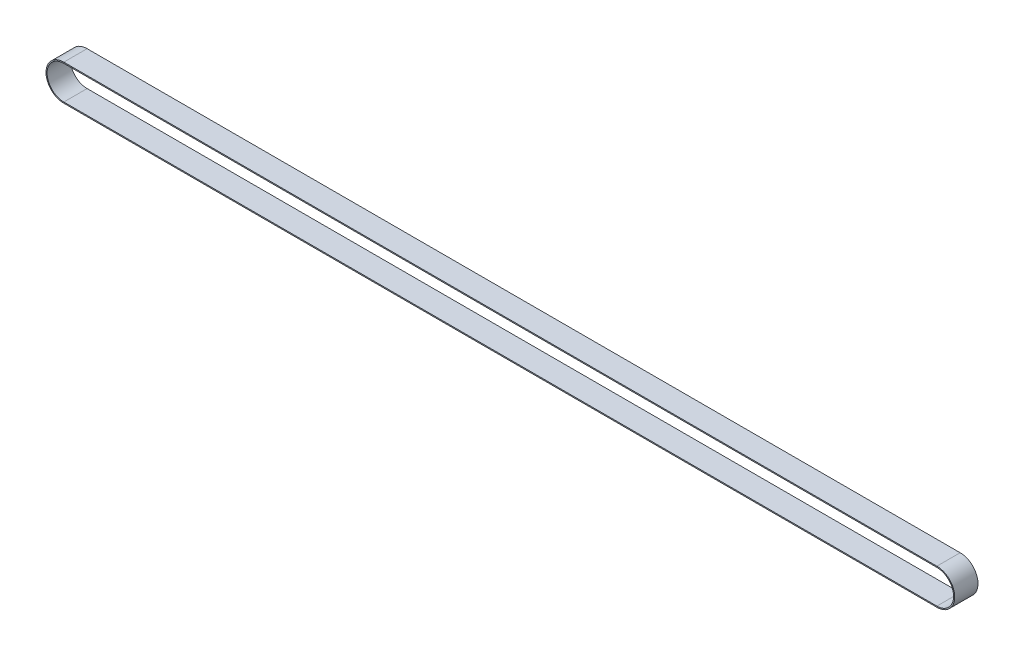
from build123d import *

# Parameters (mm, degrees)
EXTRUDE_THIN1_DEPTH = 16


with BuildPart() as part:
    # Sketch2 → Extrude-Thin1 (new, symmetric)
    with BuildSketch(Plane.XY):
        with BuildLine():
            Line((-70.5, 160.5), (1129.5, 160.5))
            ThreePointArc((1129.5, 160.5), (1154, 136), (1129.5, 111.5))
            Line((1129.5, 111.5), (-70.5, 111.5))
            ThreePointArc((-70.5, 111.5), (-95, 136), (-70.5, 160.5))
        make_face()
        with BuildLine():
            Line((-70.5, 159), (1129.5, 159))
            ThreePointArc((1129.5, 159), (1152.5, 136), (1129.5, 113))
            Line((1129.5, 113), (-70.5, 113))
            ThreePointArc((-70.5, 113), (-93.5, 136), (-70.5, 159))
        make_face(mode=Mode.SUBTRACT)
    extrude(amount=EXTRUDE_THIN1_DEPTH, both=True)


solid = part.part
